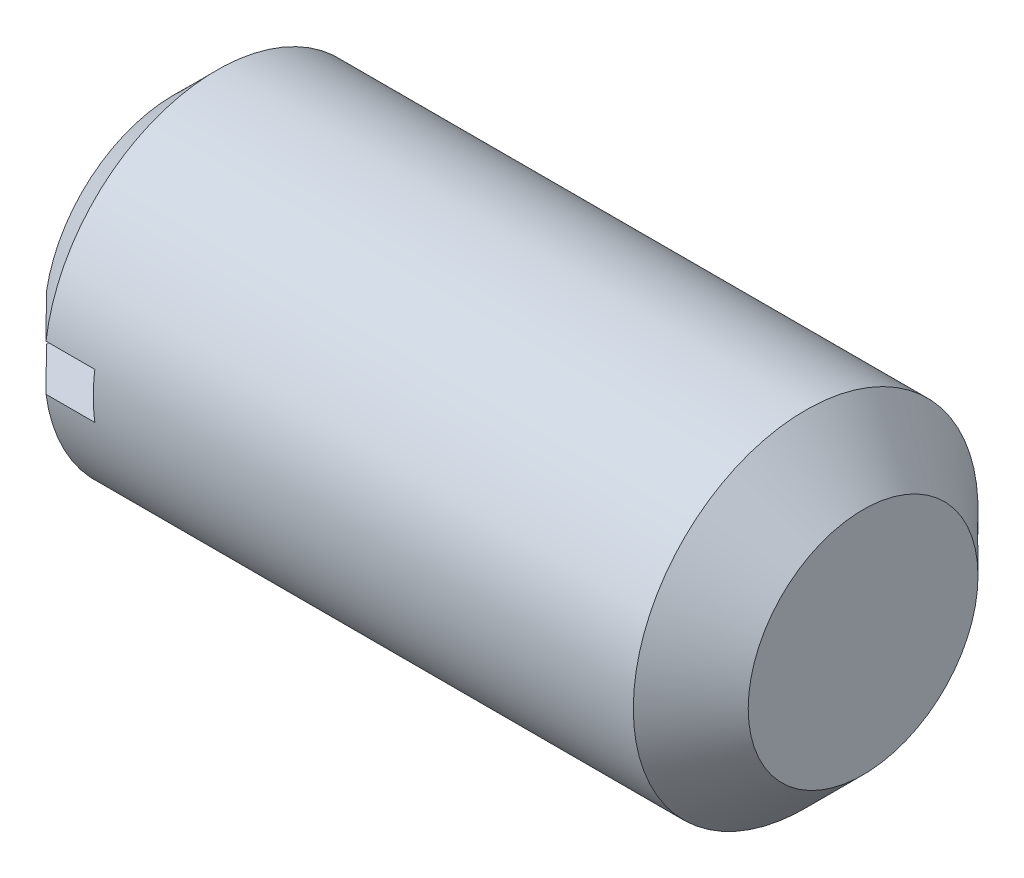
ISO-10303-21;
HEADER;
FILE_DESCRIPTION(('STEP AP214'),'2;1');
FILE_NAME('part.step','',(''),(''),'','','');
FILE_SCHEMA(('AUTOMOTIVE_DESIGN { 1 0 10303 214 1 1 1 1 }'));
ENDSEC;
DATA;
#1=APPLICATION_CONTEXT('core data for automotive mechanical design processes');
#2=APPLICATION_PROTOCOL_DEFINITION('international standard','automotive_design',2000,#1);
#3=PRODUCT_CONTEXT('',#1,'mechanical');
#4=PRODUCT('Part','Part','',(#3));
#5=PRODUCT_RELATED_PRODUCT_CATEGORY('part','',(#4));
#6=PRODUCT_DEFINITION_FORMATION('','',#4);
#7=PRODUCT_DEFINITION_CONTEXT('part definition',#1,'design');
#8=PRODUCT_DEFINITION('design','',#6,#7);
#9=PRODUCT_DEFINITION_SHAPE('','',#8);
#10=(LENGTH_UNIT() NAMED_UNIT(*) SI_UNIT(.MILLI.,.METRE.));
#11=(NAMED_UNIT(*) PLANE_ANGLE_UNIT() SI_UNIT($,.RADIAN.));
#12=(NAMED_UNIT(*) SI_UNIT($,.STERADIAN.) SOLID_ANGLE_UNIT());
#13=UNCERTAINTY_MEASURE_WITH_UNIT(LENGTH_MEASURE(1.E-05),#10,'distance_accuracy_value','');
#14=(GEOMETRIC_REPRESENTATION_CONTEXT(3) GLOBAL_UNCERTAINTY_ASSIGNED_CONTEXT((#13)) GLOBAL_UNIT_ASSIGNED_CONTEXT((#10,
#11,#12)) REPRESENTATION_CONTEXT('',''));
#15=CARTESIAN_POINT('',(0.,0.,0.));
#16=DIRECTION('',(0.,0.,1.));
#17=DIRECTION('',(1.,0.,0.));
#18=AXIS2_PLACEMENT_3D('',#15,#16,#17);
#19=CARTESIAN_POINT('',(0.,1.125,0.));
#20=DIRECTION('',(1.,0.,0.));
#21=DIRECTION('',(0.,0.,-1.));
#22=AXIS2_PLACEMENT_3D('',#19,#20,#21);
#23=PLANE('',#22);
#24=CARTESIAN_POINT('',(0.,0.,0.));
#25=DIRECTION('',(-1.,0.,0.));
#26=DIRECTION('',(0.,0.,1.));
#27=AXIS2_PLACEMENT_3D('',#24,#25,#26);
#28=CIRCLE('',#27,1.125);
#29=CARTESIAN_POINT('',(0.,0.2,1.10707949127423));
#30=VERTEX_POINT('',#29);
#31=CARTESIAN_POINT('',(0.,0.2,-1.10707949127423));
#32=VERTEX_POINT('',#31);
#33=EDGE_CURVE('E118',#30,#32,#28,.T.);
#34=ORIENTED_EDGE('',*,*,#33,.T.);
#35=DIRECTION('',(0.,0.,1.));
#36=VECTOR('',#35,1.);
#37=CARTESIAN_POINT('',(0.,0.2,-1.5));
#38=LINE('',#37,#36);
#39=EDGE_CURVE('E105',#32,#30,#38,.T.);
#40=ORIENTED_EDGE('',*,*,#39,.T.);
#41=EDGE_LOOP('',(#34,#40));
#42=FACE_BOUND('',#41,.T.);
#43=ADVANCED_FACE('F35',(#42),#23,.F.);
#44=CARTESIAN_POINT('',(0.375000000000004,0.,0.));
#45=DIRECTION('',(1.,0.,0.));
#46=DIRECTION('',(0.,0.,-1.));
#47=AXIS2_PLACEMENT_3D('',#44,#45,#46);
#48=CONICAL_SURFACE('',#47,1.5,0.785398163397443);
#49=CARTESIAN_POINT('',(0.375000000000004,0.,0.));
#50=DIRECTION('',(-1.,0.,0.));
#51=DIRECTION('',(0.,0.,1.));
#52=AXIS2_PLACEMENT_3D('',#49,#50,#51);
#53=CIRCLE('',#52,1.5);
#54=CARTESIAN_POINT('',(0.375000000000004,0.2,1.48660687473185));
#55=VERTEX_POINT('',#54);
#56=CARTESIAN_POINT('',(0.375000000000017,0.2,-1.48660687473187));
#57=VERTEX_POINT('',#56);
#58=EDGE_CURVE('E122',#55,#57,#53,.T.);
#59=ORIENTED_EDGE('',*,*,#58,.T.);
#60=CARTESIAN_POINT('',(2.18920799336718,0.2,-3.30816786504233));
#61=CARTESIAN_POINT('',(2.07649366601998,0.2,-3.19524610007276));
#62=CARTESIAN_POINT('',(1.96378832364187,0.2,-3.08231535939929));
#63=CARTESIAN_POINT('',(1.73840550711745,0.2,-2.85642283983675));
#64=CARTESIAN_POINT('',(1.6257280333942,0.2,-2.74346106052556));
#65=CARTESIAN_POINT('',(1.40037767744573,0.2,-2.51746010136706));
#66=CARTESIAN_POINT('',(1.28770480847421,0.2,-2.40442090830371));
#67=CARTESIAN_POINT('',(1.06242244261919,0.2,-2.17828252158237));
#68=CARTESIAN_POINT('',(0.949812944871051,0.2,-2.06518332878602));
#69=CARTESIAN_POINT('',(0.721578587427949,0.2,-1.83575394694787));
#70=CARTESIAN_POINT('',(0.60595653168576,0.2,-1.71942096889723));
#71=CARTESIAN_POINT('',(0.374890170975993,0.2,-1.48656880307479));
#72=CARTESIAN_POINT('',(0.259445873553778,0.2,-1.3700496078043));
#73=CARTESIAN_POINT('',(0.086582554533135,0.2,-1.19499523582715));
#74=CARTESIAN_POINT('',(0.0290178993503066,0.2,-1.13660389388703));
#75=CARTESIAN_POINT('',(-0.0859582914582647,0.2,-1.01966845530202));
#76=CARTESIAN_POINT('',(-0.143369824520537,0.2,-0.961124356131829));
#77=CARTESIAN_POINT('',(-0.257927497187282,0.2,-0.843786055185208));
#78=CARTESIAN_POINT('',(-0.315073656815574,0.2,-0.784991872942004));
#79=CARTESIAN_POINT('',(-0.428894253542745,0.2,-0.666949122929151));
#80=CARTESIAN_POINT('',(-0.485568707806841,0.2,-0.607700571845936));
#81=CARTESIAN_POINT('',(-0.556834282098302,0.2,-0.531827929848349));
#82=CARTESIAN_POINT('',(-0.571929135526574,0.2,-0.515678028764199));
#83=CARTESIAN_POINT('',(-0.602008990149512,0.2,-0.483276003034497));
#84=CARTESIAN_POINT('',(-0.616993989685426,0.2,-0.467023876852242));
#85=CARTESIAN_POINT('',(-0.661668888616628,0.2,-0.418156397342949));
#86=CARTESIAN_POINT('',(-0.691153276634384,0.2,-0.385351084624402));
#87=CARTESIAN_POINT('',(-0.738520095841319,0.2,-0.330870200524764));
#88=CARTESIAN_POINT('',(-0.756726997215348,0.2,-0.309479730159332));
#89=CARTESIAN_POINT('',(-0.792449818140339,0.2,-0.26597934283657));
#90=CARTESIAN_POINT('',(-0.809962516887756,0.2,-0.243866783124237));
#91=CARTESIAN_POINT('',(-0.8437679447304,0.2,-0.198329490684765));
#92=CARTESIAN_POINT('',(-0.860046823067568,0.2,-0.174893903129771));
#93=CARTESIAN_POINT('',(-0.882018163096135,0.2,-0.13831631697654));
#94=CARTESIAN_POINT('',(-0.888920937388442,0.2,-0.125916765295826));
#95=CARTESIAN_POINT('',(-0.901444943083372,0.2,-0.100497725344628));
#96=CARTESIAN_POINT('',(-0.907068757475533,0.2,-0.0874795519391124));
#97=CARTESIAN_POINT('',(-0.916365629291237,0.2,-0.0607035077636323));
#98=CARTESIAN_POINT('',(-0.920035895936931,0.2,-0.046944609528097));
#99=CARTESIAN_POINT('',(-0.924561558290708,0.2,-0.019019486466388));
#100=CARTESIAN_POINT('',(-0.925434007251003,0.2,-0.00485626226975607));
#101=CARTESIAN_POINT('',(-0.924139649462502,0.2,0.0233294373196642));
#102=CARTESIAN_POINT('',(-0.921970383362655,0.2,0.0373517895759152));
#103=CARTESIAN_POINT('',(-0.915181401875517,0.2,0.064842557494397));
#104=CARTESIAN_POINT('',(-0.910545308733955,0.2,0.0783066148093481));
#105=CARTESIAN_POINT('',(-0.898239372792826,0.2,0.107921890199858));
#106=CARTESIAN_POINT('',(-0.890094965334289,0.2,0.123867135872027));
#107=CARTESIAN_POINT('',(-0.872331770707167,0.2,0.154929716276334));
#108=CARTESIAN_POINT('',(-0.862709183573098,0.2,0.170044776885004));
#109=CARTESIAN_POINT('',(-0.842523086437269,0.2,0.199782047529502));
#110=CARTESIAN_POINT('',(-0.831953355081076,0.2,0.214399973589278));
#111=CARTESIAN_POINT('',(-0.810271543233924,0.2,0.24319218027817));
#112=CARTESIAN_POINT('',(-0.79916020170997,0.2,0.257367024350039));
#113=CARTESIAN_POINT('',(-0.761648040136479,0.2,0.303984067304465));
#114=CARTESIAN_POINT('',(-0.734462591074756,0.2,0.335790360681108));
#115=CARTESIAN_POINT('',(-0.679232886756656,0.2,0.398651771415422));
#116=CARTESIAN_POINT('',(-0.651188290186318,0.2,0.429706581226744));
#117=CARTESIAN_POINT('',(-0.594583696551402,0.2,0.49141985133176));
#118=CARTESIAN_POINT('',(-0.566023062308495,0.2,0.522077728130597));
#119=CARTESIAN_POINT('',(-0.508622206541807,0.2,0.583118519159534));
#120=CARTESIAN_POINT('',(-0.479782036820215,0.2,0.613501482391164));
#121=CARTESIAN_POINT('',(-0.393361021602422,0.2,0.704003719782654));
#122=CARTESIAN_POINT('',(-0.335513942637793,0.2,0.763868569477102));
#123=CARTESIAN_POINT('',(-0.219518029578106,0.2,0.883224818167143));
#124=CARTESIAN_POINT('',(-0.161369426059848,0.2,0.942716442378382));
#125=CARTESIAN_POINT('',(-0.00876825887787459,0.2,1.09833366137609));
#126=CARTESIAN_POINT('',(0.0858416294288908,0.2,1.19430497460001));
#127=CARTESIAN_POINT('',(0.275298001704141,0.2,1.38601480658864));
#128=CARTESIAN_POINT('',(0.370144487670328,0.2,1.48175332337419));
#129=CARTESIAN_POINT('',(0.654937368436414,0.2,1.76883520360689));
#130=CARTESIAN_POINT('',(0.84507847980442,0.2,1.95998539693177));
#131=CARTESIAN_POINT('',(1.22752139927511,0.2,2.34406726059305));
#132=CARTESIAN_POINT('',(1.41982522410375,0.2,2.53699691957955));
#133=CARTESIAN_POINT('',(1.80448365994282,0.2,2.92267869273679));
#134=CARTESIAN_POINT('',(1.99683823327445,0.2,3.11543084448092));
#135=CARTESIAN_POINT('',(2.18920799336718,0.2,3.30816786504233));
#136=B_SPLINE_CURVE_WITH_KNOTS('',3,(#60,#61,#62,#63,#64,#65,#66,#67,#68,#69,#70,#71,#72,#73,
#74,#75,#76,#77,#78,#79,#80,#81,#82,#83,#84,#85,#86,#87,#88,#89,#90,#91,#92,#93,#94,#95,#96,#97,
#98,#99,#100,#101,#102,#103,#104,#105,#106,#107,#108,#109,#110,#111,#112,#113,#114,#115,#116,
#117,#118,#119,#120,#121,#122,#123,#124,#125,#126,#127,#128,#129,#130,#131,#132,#133,#134,#135),
.UNSPECIFIED.,.F.,.F.,(4,2,2,2,2,2,2,2,2,2,2,2,2,2,2,2,2,2,2,2,2,2,2,2,2,2,2,2,2,2,2,2,2,2,2,2,
2,4),(0.,0.478646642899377,0.957300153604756,1.43610836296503,1.91490987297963,2.40696308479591,
2.89903663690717,3.14502260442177,3.39101266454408,3.63698385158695,3.88294604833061,
3.94926343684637,4.01558182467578,4.14789298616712,4.23214940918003,4.31675946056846,
4.40221020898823,4.444739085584,4.48718129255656,4.52968396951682,4.57192708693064,
4.61420437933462,4.6567659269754,4.71033863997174,4.76405145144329,4.81814735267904,
4.87217140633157,4.99764955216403,5.12317821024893,5.24887419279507,5.37454731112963,
5.62428482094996,5.87385340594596,6.27814619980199,6.68244241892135,7.49128561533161,
8.30849034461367,9.12542549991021),.UNSPECIFIED.);
#137=EDGE_CURVE('E58',#57,#32,#136,.T.);
#138=ORIENTED_EDGE('',*,*,#137,.T.);
#139=ORIENTED_EDGE('',*,*,#33,.F.);
#140=EDGE_CURVE('E136',#30,#55,#136,.T.);
#141=ORIENTED_EDGE('',*,*,#140,.T.);
#142=EDGE_LOOP('',(#59,#138,#139,#141));
#143=FACE_BOUND('',#142,.T.);
#144=ADVANCED_FACE('F154',(#143),#48,.T.);
#145=CARTESIAN_POINT('',(0.,-0.2,-1.10707949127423));
#146=VERTEX_POINT('',#145);
#147=CARTESIAN_POINT('',(0.,-0.2,1.10707949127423));
#148=VERTEX_POINT('',#147);
#149=EDGE_CURVE('E117',#146,#148,#28,.T.);
#150=ORIENTED_EDGE('',*,*,#149,.T.);
#151=DIRECTION('',(0.,0.,1.));
#152=VECTOR('',#151,1.);
#153=CARTESIAN_POINT('',(0.,-0.2,-1.5));
#154=LINE('',#153,#152);
#155=EDGE_CURVE('E98',#146,#148,#154,.T.);
#156=ORIENTED_EDGE('',*,*,#155,.F.);
#157=EDGE_LOOP('',(#150,#156));
#158=FACE_BOUND('',#157,.T.);
#159=ADVANCED_FACE('F37',(#158),#23,.F.);
#160=CARTESIAN_POINT('',(6.,0.,0.));
#161=DIRECTION('',(-1.,0.,0.));
#162=DIRECTION('',(0.,0.,1.));
#163=AXIS2_PLACEMENT_3D('',#160,#161,#162);
#164=PLANE('',#163);
#165=CARTESIAN_POINT('',(6.,0.,0.));
#166=DIRECTION('',(-1.,0.,0.));
#167=DIRECTION('',(0.,0.,1.));
#168=AXIS2_PLACEMENT_3D('',#165,#166,#167);
#169=CIRCLE('',#168,1.);
#170=CARTESIAN_POINT('',(6.,0.,1.));
#171=VERTEX_POINT('',#170);
#172=EDGE_CURVE('E126',#171,#171,#169,.T.);
#173=ORIENTED_EDGE('',*,*,#172,.F.);
#174=EDGE_LOOP('',(#173));
#175=FACE_BOUND('',#174,.T.);
#176=ADVANCED_FACE('F161',(#175),#164,.F.);
#177=CARTESIAN_POINT('',(6.,0.,0.));
#178=DIRECTION('',(-1.,0.,0.));
#179=DIRECTION('',(0.,0.,1.));
#180=AXIS2_PLACEMENT_3D('',#177,#178,#179);
#181=CONICAL_SURFACE('',#180,1.,0.785398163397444);
#182=CARTESIAN_POINT('',(5.5,0.,0.));
#183=DIRECTION('',(-1.,0.,0.));
#184=DIRECTION('',(0.,0.,1.));
#185=AXIS2_PLACEMENT_3D('',#182,#183,#184);
#186=CIRCLE('',#185,1.5);
#187=CARTESIAN_POINT('',(5.5,0.,1.5));
#188=VERTEX_POINT('',#187);
#189=EDGE_CURVE('E123',#188,#188,#186,.T.);
#190=ORIENTED_EDGE('',*,*,#189,.F.);
#191=EDGE_LOOP('',(#190));
#192=FACE_BOUND('',#191,.T.);
#193=ORIENTED_EDGE('',*,*,#172,.T.);
#194=EDGE_LOOP('',(#193));
#195=FACE_BOUND('',#194,.T.);
#196=ADVANCED_FACE('F166',(#192,#195),#181,.T.);
#197=CARTESIAN_POINT('',(-10.7450145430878,0.,0.));
#198=DIRECTION('',(-1.,0.,0.));
#199=DIRECTION('',(0.,0.,1.));
#200=AXIS2_PLACEMENT_3D('',#197,#198,#199);
#201=CYLINDRICAL_SURFACE('',#200,1.5);
#202=CARTESIAN_POINT('',(0.8,0.,0.));
#203=DIRECTION('',(1.,0.,0.));
#204=DIRECTION('',(0.,0.,-1.));
#205=AXIS2_PLACEMENT_3D('',#202,#203,#204);
#206=CIRCLE('',#205,1.5);
#207=CARTESIAN_POINT('',(0.8,-0.2,-1.48660687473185));
#208=VERTEX_POINT('',#207);
#209=CARTESIAN_POINT('',(0.8,0.2,-1.48660687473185));
#210=VERTEX_POINT('',#209);
#211=EDGE_CURVE('E11',#208,#210,#206,.T.);
#212=ORIENTED_EDGE('',*,*,#211,.T.);
#213=DIRECTION('',(-1.,0.,0.));
#214=VECTOR('',#213,1.);
#215=CARTESIAN_POINT('',(-10.7450145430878,0.2,-1.48660687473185));
#216=LINE('',#215,#214);
#217=EDGE_CURVE('E115',#210,#57,#216,.T.);
#218=ORIENTED_EDGE('',*,*,#217,.T.);
#219=ORIENTED_EDGE('',*,*,#58,.F.);
#220=DIRECTION('',(-1.,0.,0.));
#221=VECTOR('',#220,1.);
#222=CARTESIAN_POINT('',(-10.7450145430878,0.2,1.48660687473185));
#223=LINE('',#222,#221);
#224=CARTESIAN_POINT('',(0.8,0.2,1.48660687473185));
#225=VERTEX_POINT('',#224);
#226=EDGE_CURVE('E107',#55,#225,#223,.F.);
#227=ORIENTED_EDGE('',*,*,#226,.T.);
#228=CARTESIAN_POINT('',(0.8,-0.2,1.48660687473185));
#229=VERTEX_POINT('',#228);
#230=EDGE_CURVE('E39',#225,#229,#206,.T.);
#231=ORIENTED_EDGE('',*,*,#230,.T.);
#232=DIRECTION('',(-1.,0.,0.));
#233=VECTOR('',#232,1.);
#234=CARTESIAN_POINT('',(-10.7450145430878,-0.2,1.48660687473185));
#235=LINE('',#234,#233);
#236=CARTESIAN_POINT('',(0.375000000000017,-0.2,1.48660687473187));
#237=VERTEX_POINT('',#236);
#238=EDGE_CURVE('E97',#229,#237,#235,.T.);
#239=ORIENTED_EDGE('',*,*,#238,.T.);
#240=CARTESIAN_POINT('',(0.375000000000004,-0.2,-1.48660687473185));
#241=VERTEX_POINT('',#240);
#242=EDGE_CURVE('E104',#241,#237,#53,.T.);
#243=ORIENTED_EDGE('',*,*,#242,.F.);
#244=DIRECTION('',(-1.,0.,0.));
#245=VECTOR('',#244,1.);
#246=CARTESIAN_POINT('',(-10.7450145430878,-0.2,-1.48660687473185));
#247=LINE('',#246,#245);
#248=EDGE_CURVE('E50',#241,#208,#247,.F.);
#249=ORIENTED_EDGE('',*,*,#248,.T.);
#250=EDGE_LOOP('',(#212,#218,#219,#227,#231,#239,#243,#249));
#251=FACE_BOUND('',#250,.T.);
#252=ORIENTED_EDGE('',*,*,#189,.T.);
#253=EDGE_LOOP('',(#252));
#254=FACE_BOUND('',#253,.T.);
#255=ADVANCED_FACE('F101',(#251,#254),#201,.T.);
#256=ORIENTED_EDGE('',*,*,#242,.T.);
#257=CARTESIAN_POINT('',(2.18920799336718,-0.2,3.30816786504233));
#258=CARTESIAN_POINT('',(2.07649366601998,-0.2,3.19524610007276));
#259=CARTESIAN_POINT('',(1.96378832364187,-0.2,3.08231535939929));
#260=CARTESIAN_POINT('',(1.73840550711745,-0.2,2.85642283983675));
#261=CARTESIAN_POINT('',(1.62572803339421,-0.2,2.74346106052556));
#262=CARTESIAN_POINT('',(1.40037767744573,-0.2,2.51746010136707));
#263=CARTESIAN_POINT('',(1.28770480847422,-0.2,2.40442090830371));
#264=CARTESIAN_POINT('',(1.06242244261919,-0.2,2.17828252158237));
#265=CARTESIAN_POINT('',(0.949812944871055,-0.2,2.06518332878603));
#266=CARTESIAN_POINT('',(0.721578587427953,-0.2,1.83575394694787));
#267=CARTESIAN_POINT('',(0.605956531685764,-0.2,1.71942096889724));
#268=CARTESIAN_POINT('',(0.374890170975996,-0.2,1.48656880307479));
#269=CARTESIAN_POINT('',(0.259445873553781,-0.2,1.3700496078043));
#270=CARTESIAN_POINT('',(0.0865825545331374,-0.2,1.19499523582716));
#271=CARTESIAN_POINT('',(0.029017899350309,-0.2,1.13660389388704));
#272=CARTESIAN_POINT('',(-0.0859582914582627,-0.2,1.01966845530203));
#273=CARTESIAN_POINT('',(-0.143369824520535,-0.2,0.96112435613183));
#274=CARTESIAN_POINT('',(-0.257927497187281,-0.2,0.84378605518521));
#275=CARTESIAN_POINT('',(-0.315073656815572,-0.2,0.784991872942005));
#276=CARTESIAN_POINT('',(-0.428894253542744,-0.2,0.666949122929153));
#277=CARTESIAN_POINT('',(-0.48556870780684,-0.2,0.607700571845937));
#278=CARTESIAN_POINT('',(-0.556834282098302,-0.2,0.53182792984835));
#279=CARTESIAN_POINT('',(-0.571929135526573,-0.2,0.5156780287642));
#280=CARTESIAN_POINT('',(-0.602008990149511,-0.2,0.483276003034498));
#281=CARTESIAN_POINT('',(-0.616993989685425,-0.2,0.467023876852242));
#282=CARTESIAN_POINT('',(-0.661668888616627,-0.2,0.418156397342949));
#283=CARTESIAN_POINT('',(-0.691153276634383,-0.2,0.385351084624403));
#284=CARTESIAN_POINT('',(-0.738520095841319,-0.2,0.330870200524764));
#285=CARTESIAN_POINT('',(-0.756726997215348,-0.2,0.309479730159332));
#286=CARTESIAN_POINT('',(-0.792449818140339,-0.2,0.265979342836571));
#287=CARTESIAN_POINT('',(-0.809962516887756,-0.2,0.243866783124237));
#288=CARTESIAN_POINT('',(-0.843767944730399,-0.2,0.198329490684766));
#289=CARTESIAN_POINT('',(-0.860046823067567,-0.2,0.174893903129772));
#290=CARTESIAN_POINT('',(-0.882018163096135,-0.2,0.13831631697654));
#291=CARTESIAN_POINT('',(-0.888920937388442,-0.2,0.125916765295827));
#292=CARTESIAN_POINT('',(-0.901444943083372,-0.2,0.100497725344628));
#293=CARTESIAN_POINT('',(-0.907068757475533,-0.2,0.0874795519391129));
#294=CARTESIAN_POINT('',(-0.916365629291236,-0.2,0.0607035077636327));
#295=CARTESIAN_POINT('',(-0.920035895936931,-0.2,0.0469446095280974));
#296=CARTESIAN_POINT('',(-0.924561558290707,-0.2,0.0190194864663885));
#297=CARTESIAN_POINT('',(-0.925434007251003,-0.2,0.00485626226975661));
#298=CARTESIAN_POINT('',(-0.924139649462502,-0.2,-0.0233294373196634));
#299=CARTESIAN_POINT('',(-0.921970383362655,-0.2,-0.037351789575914));
#300=CARTESIAN_POINT('',(-0.915181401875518,-0.2,-0.064842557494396));
#301=CARTESIAN_POINT('',(-0.910545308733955,-0.2,-0.0783066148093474));
#302=CARTESIAN_POINT('',(-0.898239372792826,-0.2,-0.107921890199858));
#303=CARTESIAN_POINT('',(-0.890094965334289,-0.2,-0.123867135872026));
#304=CARTESIAN_POINT('',(-0.872331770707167,-0.2,-0.154929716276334));
#305=CARTESIAN_POINT('',(-0.862709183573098,-0.2,-0.170044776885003));
#306=CARTESIAN_POINT('',(-0.842523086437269,-0.2,-0.199782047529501));
#307=CARTESIAN_POINT('',(-0.831953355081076,-0.2,-0.214399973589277));
#308=CARTESIAN_POINT('',(-0.810271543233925,-0.2,-0.243192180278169));
#309=CARTESIAN_POINT('',(-0.799160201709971,-0.2,-0.257367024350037));
#310=CARTESIAN_POINT('',(-0.761648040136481,-0.2,-0.303984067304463));
#311=CARTESIAN_POINT('',(-0.734462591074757,-0.2,-0.335790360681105));
#312=CARTESIAN_POINT('',(-0.679232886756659,-0.2,-0.398651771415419));
#313=CARTESIAN_POINT('',(-0.651188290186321,-0.2,-0.429706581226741));
#314=CARTESIAN_POINT('',(-0.594583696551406,-0.2,-0.491419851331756));
#315=CARTESIAN_POINT('',(-0.566023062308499,-0.2,-0.522077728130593));
#316=CARTESIAN_POINT('',(-0.508622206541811,-0.2,-0.58311851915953));
#317=CARTESIAN_POINT('',(-0.47978203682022,-0.2,-0.61350148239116));
#318=CARTESIAN_POINT('',(-0.393361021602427,-0.2,-0.704003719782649));
#319=CARTESIAN_POINT('',(-0.335513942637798,-0.2,-0.763868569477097));
#320=CARTESIAN_POINT('',(-0.219518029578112,-0.2,-0.883224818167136));
#321=CARTESIAN_POINT('',(-0.161369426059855,-0.2,-0.942716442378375));
#322=CARTESIAN_POINT('',(-0.00876825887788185,-0.2,-1.09833366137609));
#323=CARTESIAN_POINT('',(0.0858416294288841,-0.2,-1.1943049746));
#324=CARTESIAN_POINT('',(0.275298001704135,-0.2,-1.38601480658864));
#325=CARTESIAN_POINT('',(0.370144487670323,-0.2,-1.48175332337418));
#326=CARTESIAN_POINT('',(0.654937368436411,-0.2,-1.76883520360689));
#327=CARTESIAN_POINT('',(0.845078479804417,-0.2,-1.95998539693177));
#328=CARTESIAN_POINT('',(1.22752139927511,-0.2,-2.34406726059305));
#329=CARTESIAN_POINT('',(1.41982522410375,-0.2,-2.53699691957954));
#330=CARTESIAN_POINT('',(1.80448365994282,-0.2,-2.92267869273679));
#331=CARTESIAN_POINT('',(1.99683823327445,-0.2,-3.11543084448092));
#332=CARTESIAN_POINT('',(2.18920799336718,-0.2,-3.30816786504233));
#333=B_SPLINE_CURVE_WITH_KNOTS('',3,(#257,#258,#259,#260,#261,#262,#263,#264,#265,#266,#267,
#268,#269,#270,#271,#272,#273,#274,#275,#276,#277,#278,#279,#280,#281,#282,#283,#284,#285,#286,
#287,#288,#289,#290,#291,#292,#293,#294,#295,#296,#297,#298,#299,#300,#301,#302,#303,#304,#305,
#306,#307,#308,#309,#310,#311,#312,#313,#314,#315,#316,#317,#318,#319,#320,#321,#322,#323,#324,
#325,#326,#327,#328,#329,#330,#331,#332),.UNSPECIFIED.,.F.,.F.,(4,2,2,2,2,2,2,2,2,2,2,2,2,2,2,2,
2,2,2,2,2,2,2,2,2,2,2,2,2,2,2,2,2,2,2,2,2,4),(0.,0.478646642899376,0.957300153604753,
1.43610836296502,1.91490987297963,2.40696308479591,2.89903663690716,3.14502260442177,
3.39101266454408,3.63698385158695,3.88294604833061,3.94926343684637,4.01558182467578,
4.14789298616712,4.23214940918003,4.31675946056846,4.40221020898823,4.444739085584,
4.48718129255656,4.52968396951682,4.57192708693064,4.61420437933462,4.6567659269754,
4.71033863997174,4.76405145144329,4.81814735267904,4.87217140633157,4.99764955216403,
5.12317821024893,5.24887419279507,5.37454731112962,5.62428482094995,5.87385340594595,
6.27814619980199,6.68244241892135,7.49128561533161,8.30849034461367,9.12542549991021),.UNSPECIFIED.);
#334=EDGE_CURVE('E135',#237,#148,#333,.T.);
#335=ORIENTED_EDGE('',*,*,#334,.T.);
#336=ORIENTED_EDGE('',*,*,#149,.F.);
#337=EDGE_CURVE('E129',#146,#241,#333,.T.);
#338=ORIENTED_EDGE('',*,*,#337,.T.);
#339=EDGE_LOOP('',(#256,#335,#336,#338));
#340=FACE_BOUND('',#339,.T.);
#341=ADVANCED_FACE('F141',(#340),#48,.T.);
#342=CARTESIAN_POINT('',(0.8,0.2,-1.5));
#343=DIRECTION('',(1.,0.,0.));
#344=DIRECTION('',(0.,0.,-1.));
#345=AXIS2_PLACEMENT_3D('',#342,#343,#344);
#346=PLANE('',#345);
#347=DIRECTION('',(0.,0.,1.));
#348=VECTOR('',#347,1.);
#349=CARTESIAN_POINT('',(0.8,0.2,-1.5));
#350=LINE('',#349,#348);
#351=EDGE_CURVE('E93',#210,#225,#350,.T.);
#352=ORIENTED_EDGE('',*,*,#351,.F.);
#353=ORIENTED_EDGE('',*,*,#211,.F.);
#354=DIRECTION('',(0.,0.,1.));
#355=VECTOR('',#354,1.);
#356=CARTESIAN_POINT('',(0.8,-0.2,-1.5));
#357=LINE('',#356,#355);
#358=EDGE_CURVE('E90',#208,#229,#357,.T.);
#359=ORIENTED_EDGE('',*,*,#358,.T.);
#360=ORIENTED_EDGE('',*,*,#230,.F.);
#361=EDGE_LOOP('',(#352,#353,#359,#360));
#362=FACE_BOUND('',#361,.T.);
#363=ADVANCED_FACE('F89',(#362),#346,.F.);
#364=CARTESIAN_POINT('',(0.,0.2,-1.5));
#365=DIRECTION('',(0.,1.,0.));
#366=DIRECTION('',(0.,0.,1.));
#367=AXIS2_PLACEMENT_3D('',#364,#365,#366);
#368=PLANE('',#367);
#369=ORIENTED_EDGE('',*,*,#351,.T.);
#370=ORIENTED_EDGE('',*,*,#226,.F.);
#371=ORIENTED_EDGE('',*,*,#140,.F.);
#372=ORIENTED_EDGE('',*,*,#39,.F.);
#373=ORIENTED_EDGE('',*,*,#137,.F.);
#374=ORIENTED_EDGE('',*,*,#217,.F.);
#375=EDGE_LOOP('',(#369,#370,#371,#372,#373,#374));
#376=FACE_BOUND('',#375,.T.);
#377=ADVANCED_FACE('F147',(#376),#368,.F.);
#378=CARTESIAN_POINT('',(0.,-0.2,-1.5));
#379=DIRECTION('',(0.,-1.,0.));
#380=DIRECTION('',(0.,0.,-1.));
#381=AXIS2_PLACEMENT_3D('',#378,#379,#380);
#382=PLANE('',#381);
#383=ORIENTED_EDGE('',*,*,#358,.F.);
#384=ORIENTED_EDGE('',*,*,#248,.F.);
#385=ORIENTED_EDGE('',*,*,#337,.F.);
#386=ORIENTED_EDGE('',*,*,#155,.T.);
#387=ORIENTED_EDGE('',*,*,#334,.F.);
#388=ORIENTED_EDGE('',*,*,#238,.F.);
#389=EDGE_LOOP('',(#383,#384,#385,#386,#387,#388));
#390=FACE_BOUND('',#389,.T.);
#391=ADVANCED_FACE('F95',(#390),#382,.F.);
#392=CLOSED_SHELL('',(#43,#144,#159,#176,#196,#255,#341,#363,#377,#391));
#393=MANIFOLD_SOLID_BREP('B2',#392);
#394=ADVANCED_BREP_SHAPE_REPRESENTATION('',(#18,#393),#14);
#395=SHAPE_DEFINITION_REPRESENTATION(#9,#394);
ENDSEC;
END-ISO-10303-21;
